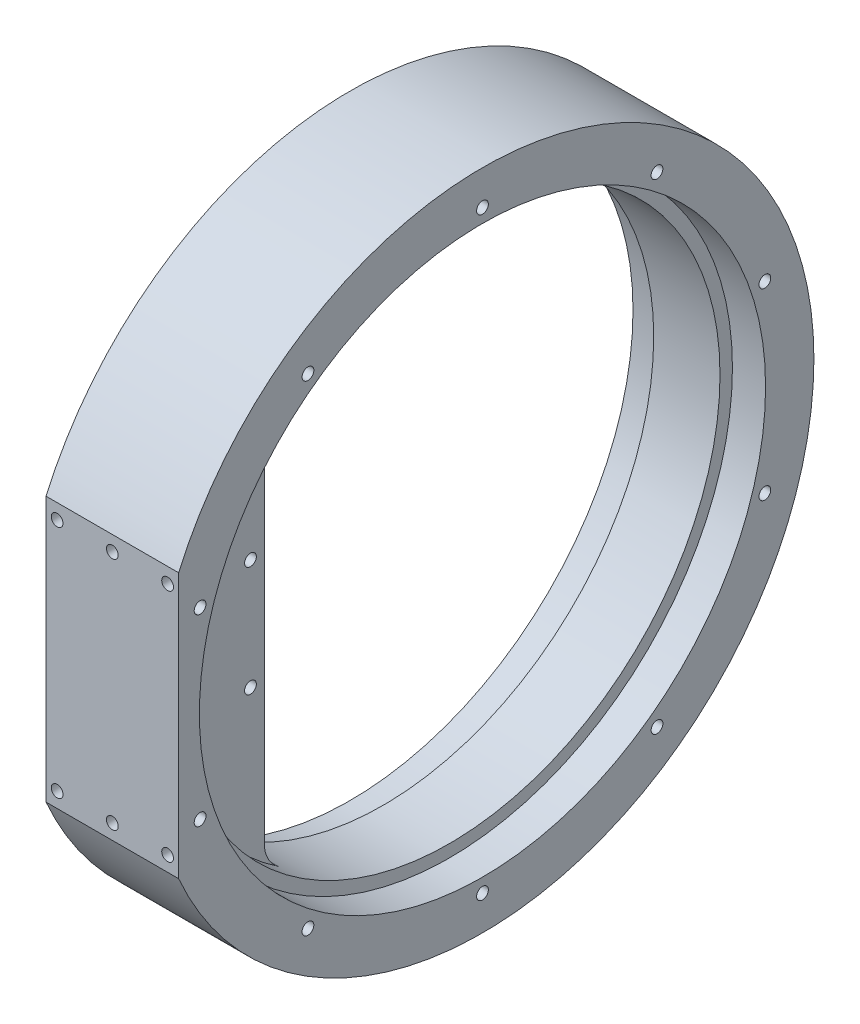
from build123d import *

# Parameters (mm, degrees)
CIRPATTERN1_COUNT          = 10
CUT_EXTRUDE1_DEPTH         = 111.161062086
CUT_EXTRUDE1_DEPTH_BACK    = 111.161062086
EXTRUDE1_DEPTH             = 3.175
EXTRUDE1_DEPTH_BACK        = 3.175
F_6_32_TAPPED_HOLE2_REACH  = 168.312
F_6_32_TAPPED_HOLE2_BORE_R = 1.35255
FILLET1_R                  = 7.62
F_6_32_TAPPED_HOLE3_D      = 2.7051


with BuildPart() as part:
    # Sketch1 → Revolve1 (revolve)
    with BuildSketch(Plane.XY, mode=Mode.PRIVATE) as revolve1_sk:
        Polygon((0, 62.23), (0, 65.0875), (7.62, 65.0875), (7.62, 76.2), (-7.62, 76.2), (-7.62, 62.23), align=None)
    revolve1 = revolve(revolve1_sk.sketch.rotate(Axis((0, 0, 0), (-1, 0, 0)), 90), axis=Axis((0, 0, 0), (-1, 0, 0)))

    # Sketch2 → 6-32 Tapped Hole1 (revolve, cut)
    with BuildSketch(Plane(origin=(7.62, 68.2625, 0), x_dir=(0, 0, -1), z_dir=(0, 1, 0))):
        Polygon((0, 0), (0, 12.27455), (1.35255, 10.922), (1.35255, 0), align=None)
    f_6_32_tapped_hole1 = revolve(axis=Axis((13.97, 68.2625, 0), (-1, 0, 0)), mode=Mode.SUBTRACT)

    # CirPattern1: 6-32 Tapped Hole1 ×10 about axis
    cirpattern1_axis = Axis((0, 0, 0), (1, 0, 0))
    for i in range(1, CIRPATTERN1_COUNT):
        add(f_6_32_tapped_hole1.rotate(cirpattern1_axis, i * 360 / CIRPATTERN1_COUNT), mode=Mode.SUBTRACT)

    # Mirror1: Revolve1, 6-32 Tapped Hole1 across plane
    add(revolve1.mirror(Plane.ZY.offset(7.62)))
    add(f_6_32_tapped_hole1.mirror(Plane.ZY.offset(7.62)), mode=Mode.SUBTRACT)

    # Mirror1 copy 1 sketch → Mirror1 copy 1 (revolve, cut)
    with BuildSketch(Plane(origin=(-22.86, 55.225522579, 40.123690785), x_dir=(0, 0.5877852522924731, -0.8090169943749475), z_dir=(0, 0.8090169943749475, 0.5877852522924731))):
        Polygon((0, 0), (0, -12.27455), (1.35255, -10.922), (1.35255, 0), align=None)
    revolve(axis=Axis((-29.21, 55.225522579, 40.123690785), (-1, 0, 0)), mode=Mode.SUBTRACT)

    # Mirror1 copy 2 sketch → Mirror1 copy 2 (revolve, cut)
    with BuildSketch(Plane(origin=(-22.86, 21.094272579, 64.921495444), x_dir=(0, 0.9510565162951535, -0.30901699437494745), z_dir=(0, 0.30901699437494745, 0.9510565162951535))):
        Polygon((0, 0), (0, -12.27455), (1.35255, -10.922), (1.35255, 0), align=None)
    revolve(axis=Axis((-29.21, 21.094272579, 64.921495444), (-1, 0, 0)), mode=Mode.SUBTRACT)

    # Mirror1 copy 3 sketch → Mirror1 copy 3 (revolve, cut)
    with BuildSketch(Plane(origin=(-22.86, -21.094272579, 64.921495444), x_dir=(0, 0.9510565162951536, 0.30901699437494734), z_dir=(0, -0.30901699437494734, 0.9510565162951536))):
        Polygon((0, 0), (0, -12.27455), (1.35255, -10.922), (1.35255, 0), align=None)
    revolve(axis=Axis((-29.21, -21.094272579, 64.921495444), (-1, 0, 0)), mode=Mode.SUBTRACT)

    # Mirror1 copy 4 sketch → Mirror1 copy 4 (revolve, cut)
    with BuildSketch(Plane(origin=(-22.86, -55.225522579, 40.123690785), x_dir=(0, 0.5877852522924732, 0.8090169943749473), z_dir=(0, -0.8090169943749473, 0.5877852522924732))):
        Polygon((0, 0), (0, -12.27455), (1.35255, -10.922), (1.35255, 0), align=None)
    revolve(axis=Axis((-29.21, -55.225522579, 40.123690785), (-1, 0, 0)), mode=Mode.SUBTRACT)

    # Mirror1 copy 5 sketch → Mirror1 copy 5 (revolve, cut)
    with BuildSketch(Plane(origin=(-22.86, -68.2625, 0), x_dir=(0, 0, 1), z_dir=(0, -1, 0))):
        Polygon((0, 0), (0, -12.27455), (1.35255, -10.922), (1.35255, 0), align=None)
    revolve(axis=Axis((-29.21, -68.2625, 0), (-1, 0, 0)), mode=Mode.SUBTRACT)

    # Mirror1 copy 6 sketch → Mirror1 copy 6 (revolve, cut)
    with BuildSketch(Plane(origin=(-22.86, -55.225522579, -40.123690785), x_dir=(0, -0.587785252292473, 0.8090169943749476), z_dir=(0, -0.8090169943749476, -0.587785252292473))):
        Polygon((0, 0), (0, -12.27455), (1.35255, -10.922), (1.35255, 0), align=None)
    revolve(axis=Axis((-29.21, -55.225522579, -40.123690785), (-1, 0, 0)), mode=Mode.SUBTRACT)

    # Mirror1 copy 7 sketch → Mirror1 copy 7 (revolve, cut)
    with BuildSketch(Plane(origin=(-22.86, -21.094272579, -64.921495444), x_dir=(0, -0.9510565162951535, 0.30901699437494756), z_dir=(0, -0.30901699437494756, -0.9510565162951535))):
        Polygon((0, 0), (0, -12.27455), (1.35255, -10.922), (1.35255, 0), align=None)
    revolve(axis=Axis((-29.21, -21.094272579, -64.921495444), (-1, 0, 0)), mode=Mode.SUBTRACT)

    # Mirror1 copy 8 sketch → Mirror1 copy 8 (revolve, cut)
    with BuildSketch(Plane(origin=(-22.86, 21.094272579, -64.921495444), x_dir=(0, -0.9510565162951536, -0.30901699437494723), z_dir=(0, 0.30901699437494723, -0.9510565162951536))):
        Polygon((0, 0), (0, -12.27455), (1.35255, -10.922), (1.35255, 0), align=None)
    revolve(axis=Axis((-29.21, 21.094272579, -64.921495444), (-1, 0, 0)), mode=Mode.SUBTRACT)

    # Mirror1 copy 9 sketch → Mirror1 copy 9 (revolve, cut)
    with BuildSketch(Plane(origin=(-22.86, 55.225522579, -40.123690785), x_dir=(0, -0.5877852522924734, -0.8090169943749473), z_dir=(0, 0.8090169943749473, -0.5877852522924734))):
        Polygon((0, 0), (0, -12.27455), (1.35255, -10.922), (1.35255, 0), align=None)
    revolve(axis=Axis((-29.21, 55.225522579, -40.123690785), (-1, 0, 0)), mode=Mode.SUBTRACT)

    # Sketch4 → Cut-Extrude1 (cut, two sides: drawn at the far end of the back side and taken through both)
    with BuildSketch(Plane(origin=(0, 0, 0), x_dir=(1, 0, 0), z_dir=(0, 1, 0)).offset(-CUT_EXTRUDE1_DEPTH_BACK)):
        Polygon((-58.859807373, -98.881975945), (-13.335, -98.881975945), (27.668743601, -98.881975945), (27.668743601, -69.85), (-13.335, -69.85), (-58.859807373, -69.85), align=None)
    extrude(amount=CUT_EXTRUDE1_DEPTH + CUT_EXTRUDE1_DEPTH_BACK, mode=Mode.SUBTRACT)

    # Sketch7 → Extrude1 (add, two sides: drawn at the far end of the back side and taken through both)
    with BuildSketch(Plane.ZY.offset(7.62).offset(-EXTRUDE1_DEPTH_BACK)):
        with BuildLine():
            Line((38.1, -49.203281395), (38.1, 49.203281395))
            ThreePointArc((38.1, 49.203281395), (62.23, 0), (38.1, -49.203281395))
        make_face()
    extrude(amount=EXTRUDE1_DEPTH + EXTRUDE1_DEPTH_BACK)

    # 6-32 Tapped Hole2 bore → 6-32 Tapped Hole2 (cut, up to next)
    with BuildSketch(Plane.XY.offset(69.85), mode=Mode.PRIVATE) as f_6_32_tapped_hole2_sk1:
        with Locations((5.08, 26.9875)):
            Circle(F_6_32_TAPPED_HOLE2_BORE_R)
    f_6_32_tapped_hole2_tool1 = extrude(f_6_32_tapped_hole2_sk1.sketch, amount=-F_6_32_TAPPED_HOLE2_REACH, mode=Mode.PRIVATE) & part.part
    # 6-32 Tapped Hole2 bore → 6-32 Tapped Hole2 (cut, up to next)
    with BuildSketch(Plane.XY.offset(69.85), mode=Mode.PRIVATE) as f_6_32_tapped_hole2_sk2:
        with Locations((-20.32, 26.9875)):
            Circle(F_6_32_TAPPED_HOLE2_BORE_R)
    f_6_32_tapped_hole2_tool2 = extrude(f_6_32_tapped_hole2_sk2.sketch, amount=-F_6_32_TAPPED_HOLE2_REACH, mode=Mode.PRIVATE) & part.part
    # 6-32 Tapped Hole2 bore → 6-32 Tapped Hole2 (cut, up to next)
    with BuildSketch(Plane.XY.offset(69.85), mode=Mode.PRIVATE) as f_6_32_tapped_hole2_sk3:
        with Locations((-20.32, -26.9875)):
            Circle(F_6_32_TAPPED_HOLE2_BORE_R)
    f_6_32_tapped_hole2_tool3 = extrude(f_6_32_tapped_hole2_sk3.sketch, amount=-F_6_32_TAPPED_HOLE2_REACH, mode=Mode.PRIVATE) & part.part
    # 6-32 Tapped Hole2 bore → 6-32 Tapped Hole2 (cut, up to next)
    with BuildSketch(Plane.XY.offset(69.85), mode=Mode.PRIVATE) as f_6_32_tapped_hole2_sk4:
        with Locations((5.08, -26.9875)):
            Circle(F_6_32_TAPPED_HOLE2_BORE_R)
    f_6_32_tapped_hole2_tool4 = extrude(f_6_32_tapped_hole2_sk4.sketch, amount=-F_6_32_TAPPED_HOLE2_REACH, mode=Mode.PRIVATE) & part.part
    # 6-32 Tapped Hole2 bore → 6-32 Tapped Hole2 (cut, up to next)
    with BuildSketch(Plane.XY.offset(69.85), mode=Mode.PRIVATE) as f_6_32_tapped_hole2_sk5:
        with Locations((-7.62, -26.9875)):
            Circle(F_6_32_TAPPED_HOLE2_BORE_R)
    f_6_32_tapped_hole2_tool5 = extrude(f_6_32_tapped_hole2_sk5.sketch, amount=-F_6_32_TAPPED_HOLE2_REACH, mode=Mode.PRIVATE) & part.part
    # 6-32 Tapped Hole2 bore → 6-32 Tapped Hole2 (cut, up to next)
    with BuildSketch(Plane.XY.offset(69.85), mode=Mode.PRIVATE) as f_6_32_tapped_hole2_sk6:
        with Locations((-7.62, 26.9875)):
            Circle(F_6_32_TAPPED_HOLE2_BORE_R)
    f_6_32_tapped_hole2_tool6 = extrude(f_6_32_tapped_hole2_sk6.sketch, amount=-F_6_32_TAPPED_HOLE2_REACH, mode=Mode.PRIVATE) & part.part
    add(f_6_32_tapped_hole2_tool1.solids().sort_by_distance((5.08, 26.9875, 69.85))[0], mode=Mode.SUBTRACT)
    add(f_6_32_tapped_hole2_tool2.solids().sort_by_distance((-20.32, 26.9875, 69.85))[0], mode=Mode.SUBTRACT)
    add(f_6_32_tapped_hole2_tool3.solids().sort_by_distance((-20.32, -26.9875, 69.85))[0], mode=Mode.SUBTRACT)
    add(f_6_32_tapped_hole2_tool4.solids().sort_by_distance((5.08, -26.9875, 69.85))[0], mode=Mode.SUBTRACT)
    add(f_6_32_tapped_hole2_tool5.solids().sort_by_distance((-7.62, -26.9875, 69.85))[0], mode=Mode.SUBTRACT)
    add(f_6_32_tapped_hole2_tool6.solids().sort_by_distance((-7.62, 26.9875, 69.85))[0], mode=Mode.SUBTRACT)

    # Fillet1
    fillet1_edges = [part.edges().sort_by_distance(p)[0] for p in [
        (-6.0325, -49.203281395, 38.1),
        (-9.2075, 49.203281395, 38.1),
    ]]
    fillet(fillet1_edges, radius=FILLET1_R)

    # 6-32 Tapped Hole3 (through all)
    with Locations(Plane.ZY.offset(10.795)):
        with Locations((41.275, 12.7), (41.275, -12.7)):
            Hole(F_6_32_TAPPED_HOLE3_D / 2)


solid = part.part
